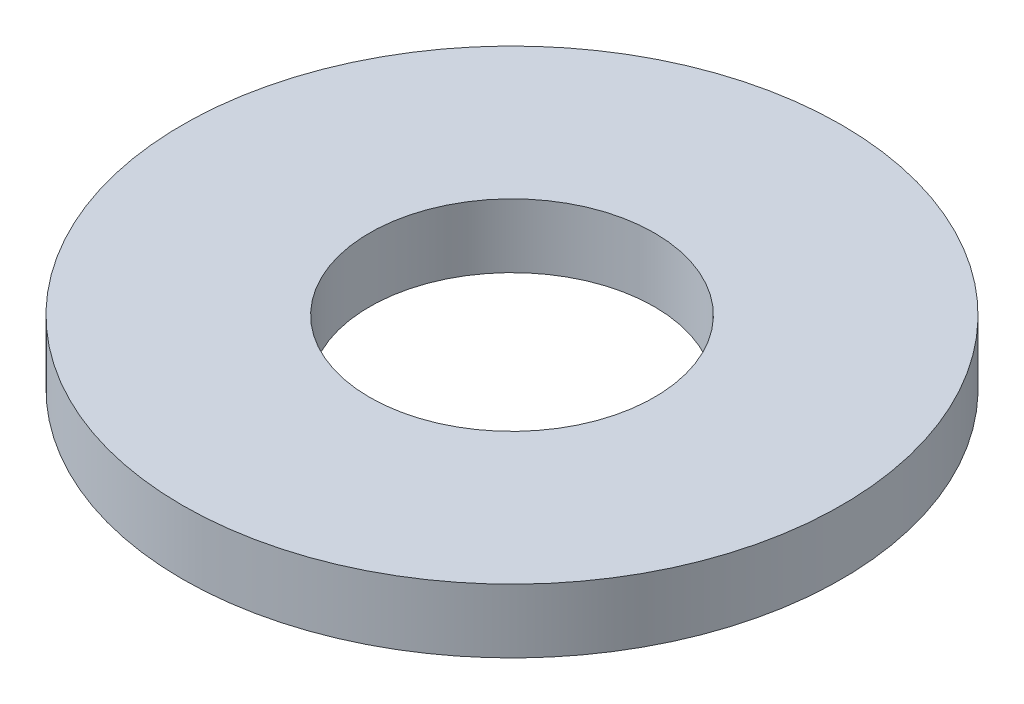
ISO-10303-21;
HEADER;
FILE_DESCRIPTION(('STEP AP214'),'2;1');
FILE_NAME('part.step','',(''),(''),'','','');
FILE_SCHEMA(('AUTOMOTIVE_DESIGN { 1 0 10303 214 1 1 1 1 }'));
ENDSEC;
DATA;
#1=APPLICATION_CONTEXT('core data for automotive mechanical design processes');
#2=APPLICATION_PROTOCOL_DEFINITION('international standard','automotive_design',2000,#1);
#3=PRODUCT_CONTEXT('',#1,'mechanical');
#4=PRODUCT('Part','Part','',(#3));
#5=PRODUCT_RELATED_PRODUCT_CATEGORY('part','',(#4));
#6=PRODUCT_DEFINITION_FORMATION('','',#4);
#7=PRODUCT_DEFINITION_CONTEXT('part definition',#1,'design');
#8=PRODUCT_DEFINITION('design','',#6,#7);
#9=PRODUCT_DEFINITION_SHAPE('','',#8);
#10=(LENGTH_UNIT() NAMED_UNIT(*) SI_UNIT(.MILLI.,.METRE.));
#11=(NAMED_UNIT(*) PLANE_ANGLE_UNIT() SI_UNIT($,.RADIAN.));
#12=(NAMED_UNIT(*) SI_UNIT($,.STERADIAN.) SOLID_ANGLE_UNIT());
#13=UNCERTAINTY_MEASURE_WITH_UNIT(LENGTH_MEASURE(1.E-05),#10,'distance_accuracy_value','');
#14=(GEOMETRIC_REPRESENTATION_CONTEXT(3) GLOBAL_UNCERTAINTY_ASSIGNED_CONTEXT((#13)) GLOBAL_UNIT_ASSIGNED_CONTEXT((#10,
#11,#12)) REPRESENTATION_CONTEXT('',''));
#15=CARTESIAN_POINT('',(0.,0.,0.));
#16=DIRECTION('',(0.,0.,1.));
#17=DIRECTION('',(1.,0.,0.));
#18=AXIS2_PLACEMENT_3D('',#15,#16,#17);
#19=CARTESIAN_POINT('',(0.,0.889,0.));
#20=DIRECTION('',(0.,1.,0.));
#21=DIRECTION('',(0.,0.,1.));
#22=AXIS2_PLACEMENT_3D('',#19,#20,#21);
#23=PLANE('',#22);
#24=CARTESIAN_POINT('',(0.,0.889,0.));
#25=DIRECTION('',(0.,1.,0.));
#26=DIRECTION('',(0.,0.,1.));
#27=AXIS2_PLACEMENT_3D('',#24,#25,#26);
#28=CIRCLE('',#27,4.5847);
#29=CARTESIAN_POINT('',(0.,0.889,4.5847));
#30=VERTEX_POINT('',#29);
#31=EDGE_CURVE('E10',#30,#30,#28,.T.);
#32=ORIENTED_EDGE('',*,*,#31,.T.);
#33=EDGE_LOOP('',(#32));
#34=FACE_BOUND('',#33,.T.);
#35=CARTESIAN_POINT('',(0.,0.889,0.));
#36=DIRECTION('',(0.,1.,0.));
#37=DIRECTION('',(0.,0.,1.));
#38=AXIS2_PLACEMENT_3D('',#35,#36,#37);
#39=CIRCLE('',#38,1.9812);
#40=CARTESIAN_POINT('',(0.,0.889,1.9812));
#41=VERTEX_POINT('',#40);
#42=EDGE_CURVE('E44',#41,#41,#39,.T.);
#43=ORIENTED_EDGE('',*,*,#42,.F.);
#44=EDGE_LOOP('',(#43));
#45=FACE_BOUND('',#44,.T.);
#46=ADVANCED_FACE('F33',(#34,#45),#23,.T.);
#47=CARTESIAN_POINT('',(0.,0.,0.));
#48=DIRECTION('',(0.,1.,0.));
#49=DIRECTION('',(0.,0.,1.));
#50=AXIS2_PLACEMENT_3D('',#47,#48,#49);
#51=PLANE('',#50);
#52=CARTESIAN_POINT('',(0.,0.,0.));
#53=DIRECTION('',(0.,1.,0.));
#54=DIRECTION('',(0.,0.,1.));
#55=AXIS2_PLACEMENT_3D('',#52,#53,#54);
#56=CIRCLE('',#55,4.5847);
#57=CARTESIAN_POINT('',(0.,0.,4.5847));
#58=VERTEX_POINT('',#57);
#59=EDGE_CURVE('E37',#58,#58,#56,.T.);
#60=ORIENTED_EDGE('',*,*,#59,.F.);
#61=EDGE_LOOP('',(#60));
#62=FACE_BOUND('',#61,.T.);
#63=CARTESIAN_POINT('',(0.,0.,0.));
#64=DIRECTION('',(0.,1.,0.));
#65=DIRECTION('',(0.,0.,1.));
#66=AXIS2_PLACEMENT_3D('',#63,#64,#65);
#67=CIRCLE('',#66,1.9812);
#68=CARTESIAN_POINT('',(0.,0.,1.9812));
#69=VERTEX_POINT('',#68);
#70=EDGE_CURVE('E46',#69,#69,#67,.T.);
#71=ORIENTED_EDGE('',*,*,#70,.T.);
#72=EDGE_LOOP('',(#71));
#73=FACE_BOUND('',#72,.T.);
#74=ADVANCED_FACE('F56',(#62,#73),#51,.F.);
#75=CARTESIAN_POINT('',(0.,0.889,0.));
#76=DIRECTION('',(0.,-1.,0.));
#77=DIRECTION('',(0.,0.,-1.));
#78=AXIS2_PLACEMENT_3D('',#75,#76,#77);
#79=CYLINDRICAL_SURFACE('',#78,4.5847);
#80=ORIENTED_EDGE('',*,*,#31,.F.);
#81=EDGE_LOOP('',(#80));
#82=FACE_BOUND('',#81,.T.);
#83=ORIENTED_EDGE('',*,*,#59,.T.);
#84=EDGE_LOOP('',(#83));
#85=FACE_BOUND('',#84,.T.);
#86=ADVANCED_FACE('F35',(#82,#85),#79,.T.);
#87=CARTESIAN_POINT('',(0.,0.889,0.));
#88=DIRECTION('',(0.,-1.,0.));
#89=DIRECTION('',(0.,0.,-1.));
#90=AXIS2_PLACEMENT_3D('',#87,#88,#89);
#91=CYLINDRICAL_SURFACE('',#90,1.9812);
#92=ORIENTED_EDGE('',*,*,#42,.T.);
#93=EDGE_LOOP('',(#92));
#94=FACE_BOUND('',#93,.T.);
#95=ORIENTED_EDGE('',*,*,#70,.F.);
#96=EDGE_LOOP('',(#95));
#97=FACE_BOUND('',#96,.T.);
#98=ADVANCED_FACE('F52',(#94,#97),#91,.F.);
#99=CLOSED_SHELL('',(#46,#74,#86,#98));
#100=MANIFOLD_SOLID_BREP('B2',#99);
#101=ADVANCED_BREP_SHAPE_REPRESENTATION('',(#18,#100),#14);
#102=SHAPE_DEFINITION_REPRESENTATION(#9,#101);
ENDSEC;
END-ISO-10303-21;
